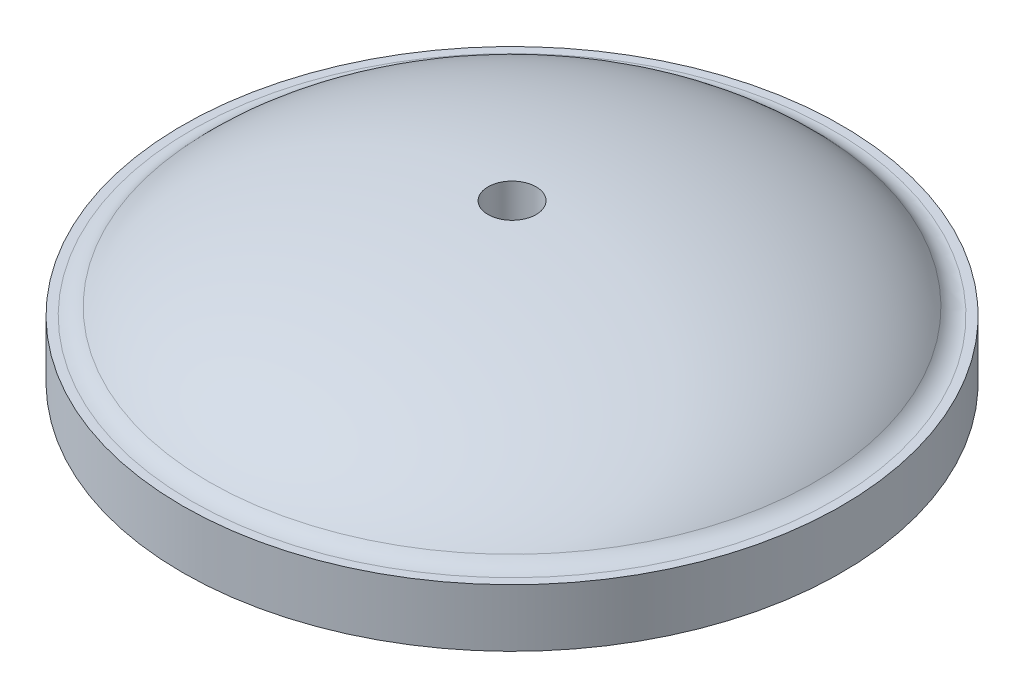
from build123d import *

# Parameters (mm, degrees)
RIBS_EXTRUDE_REACH = 129.625
CIRPATTERN2_COUNT  = 5
CUT_EXTRUDE1_REACH = 129.625
SKETCH4_R          = 6.35


with BuildPart() as part:
    # Sketch2 → Base-Revolve (revolve)
    with BuildSketch(Plane.XY, mode=Mode.PRIVATE) as base_revolve_sk:
        with BuildLine():
            Line((13.335, 22.424245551), (13.335, 5.9944))
            Line((13.335, 5.9944), (5.842, 5.9944))
            Line((5.842, 5.9944), (5.842, 39.909717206))
            add(Edge.make_bspline(
                [(80.062159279, 15.652796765), (59.153222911, 38.260100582), (5.842, 39.909717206)],
                knots=[0.402065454, 0.402065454, 0.402065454, 1.503596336, 1.503596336, 1.503596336], degree=2, weights=[1, 0.852124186, 1]))
            ThreePointArc((80.062159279, 15.652796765), (82.179985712, 14.14627399), (84.723980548, 13.6144))
            Line((84.723980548, 13.6144), (87, 13.6144))
            Line((87, 13.6144), (87, -1.6256))
            Line((87, -1.6256), (82.55, -1.6256))
            Line((82.55, -1.6256), (82.55, 5.9944))
            Line((82.55, 5.9944), (71.5, 5.9944))
            Line((71.5, 5.9944), (71.5, 9.724245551))
            ThreePointArc((71.5, 9.724245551), (67.780256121, 18.704501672), (58.8, 22.424245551))
            Line((58.8, 22.424245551), (13.335, 22.424245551))
        make_face()
    revolve(base_revolve_sk.sketch.rotate(Axis((0, 86.36, 0), (0, -1, 0)), 90), axis=Axis((0, 86.36, 0), (0, -1, 0)))

    # Ribs Extrude: up to this face of the body (flat: up to its plane)
    ribs_extrude_end = Plane(part.part.faces().sort_by_distance((0, 22.424245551, -57.136884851))[0])
    # Sketch3 → Ribs Extrude (add, up to the picked face)
    with BuildSketch(Plane.XZ.offset(-5.9944), mode=Mode.PRIVATE) as ribs_extrude_sk1:
        with BuildLine():
            Line((-5.08, 71.319307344), (-5.08, 12.329469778))
            ThreePointArc((-5.08, 12.329469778), (0, 13.335), (5.08, 12.329469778))
            Line((5.08, 12.329469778), (5.08, 71.319307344))
            ThreePointArc((5.08, 71.319307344), (0, 71.5), (-5.08, 71.319307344))
        make_face()
    ribs_extrude_tool1 = split(extrude(ribs_extrude_sk1.sketch, amount=-RIBS_EXTRUDE_REACH, mode=Mode.PRIVATE), bisect_by=ribs_extrude_end, keep=Keep.BOTH, mode=Mode.PRIVATE)
    ribs_extrude = ribs_extrude_tool1.solids().sort_by(Axis((0, 5.9944, 42.221688), (0, 1, 0)))[0]
    add(ribs_extrude)

    # CirPattern2: Ribs Extrude ×5 about axis
    cirpattern2_axis = Axis((0, 0, 0), (0, 1, 0))
    for i in range(1, CIRPATTERN2_COUNT):
        add(ribs_extrude.rotate(cirpattern2_axis, i * 360 / CIRPATTERN2_COUNT))

    # Sketch4 → Cut-Extrude1 (cut, up to next)
    with BuildSketch(Plane.XZ.offset(-5.9944), mode=Mode.PRIVATE) as cut_extrude1_sk1:
        with Locations(Location((0, 0, 0), (0, 0, 270))):
            Circle(SKETCH4_R)
    cut_extrude1_tool1 = extrude(cut_extrude1_sk1.sketch, amount=-CUT_EXTRUDE1_REACH, mode=Mode.PRIVATE) & part.part
    add(cut_extrude1_tool1.solids().sort_by_distance((0, 5.9944, 0))[0], mode=Mode.SUBTRACT)


solid = part.part
